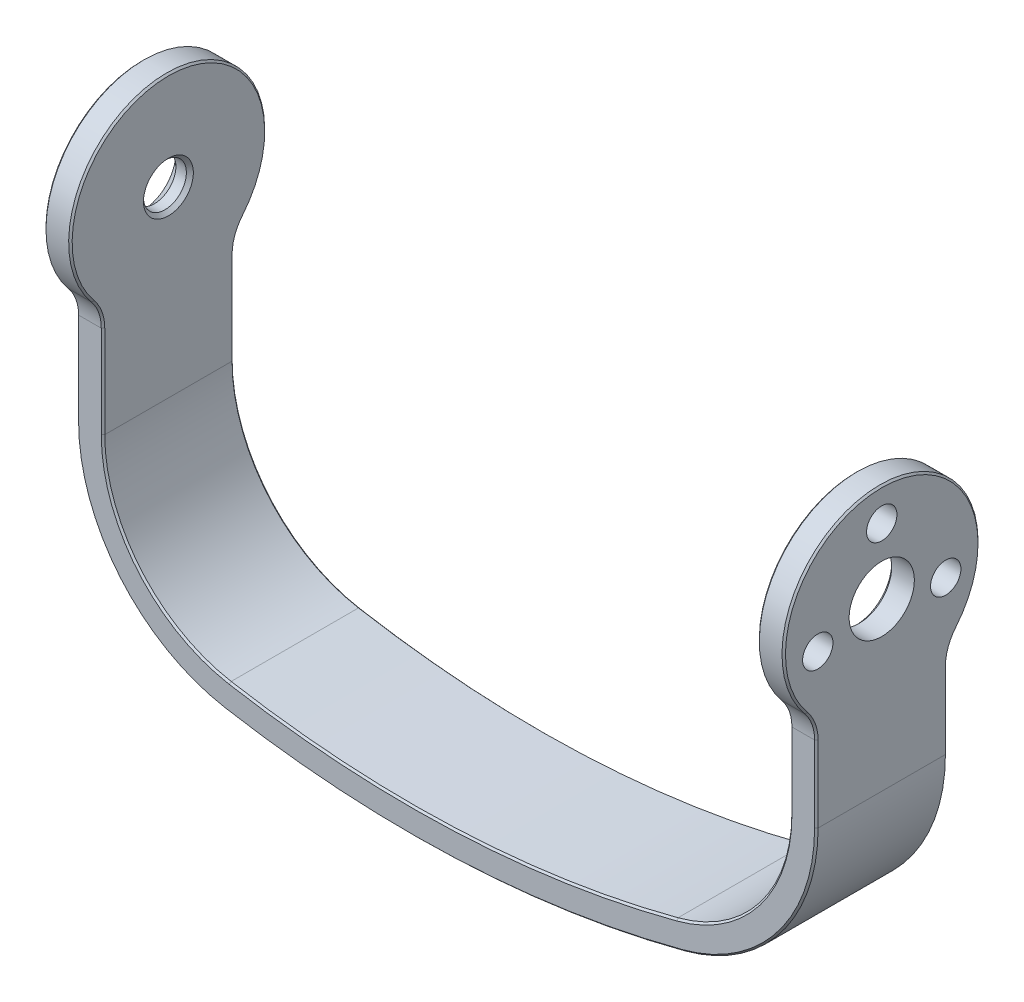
from build123d import *

# Parameters (mm, degrees)
BOSS_EXTRUDE1_DEPTH = 4.7625
SKETCH3_R           = 7.1374
BOSS_EXTRUDE3_DEPTH = 1.905
BOSS_EXTRUDE4_START = -51.943
SKETCH3_2_R         = 7.1374
BOSS_EXTRUDE4_DEPTH = 1.905
CUT_EXTRUDE1_REACH  = 62.796
SKETCH4_R           = 1.5621
CUT_EXTRUDE2_REACH  = 62.796
SKETCH5_R           = 2.3749
SKETCH5_R_2         = 1.1049
CHAMFER1_SIZE       = 0.254
CHAMFER2_SIZE       = 0.254
CHAMFER3_SIZE       = 0.889
FILLET1_R           = 3.175
CHAMFER4_SIZE       = 0.127


with BuildPart() as part:
    # Sketch1 → Boss-Extrude1 (new, symmetric)
    with BuildSketch(Plane.XY):
        with BuildLine():
            Line((-22.352, 0), (-22.352, -13.299052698))
            ThreePointArc((-22.352, -13.299052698), (-19.745105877, -20.455066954), (-13.146135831, -24.257438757))
            ThreePointArc((-13.146135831, -24.257438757), (3.196794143, -25.332913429), (19.392037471, -22.891172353))
            ThreePointArc((19.392037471, -22.891172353), (25.37182032, -18.924609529), (27.686, -12.132261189))
            Line((27.686, -12.132261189), (27.686, 0))
            Line((27.686, 0), (29.591, 0))
            Line((29.591, 0), (29.591, -12.132261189))
            ThreePointArc((29.591, -12.132261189), (26.880556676, -20.087682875), (19.876838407, -24.733451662))
            ThreePointArc((19.876838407, -24.733451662), (3.276713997, -27.236236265), (-13.474789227, -26.133874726))
            ThreePointArc((-13.474789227, -26.133874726), (-21.203719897, -21.68041186), (-24.257, -13.299052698))
            Line((-24.257, -13.299052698), (-24.257, 0))
            Line((-24.257, 0), (-22.352, 0))
        make_face()
    extrude(amount=BOSS_EXTRUDE1_DEPTH, both=True)

    # Sketch3 → Boss-Extrude3 (add)
    with BuildSketch(Plane.ZY.offset(24.257)):
        Circle(SKETCH3_R)
    extrude(amount=-BOSS_EXTRUDE3_DEPTH)

    # Sketch3_2 → Boss-Extrude4 (add)
    with BuildSketch(Plane.ZY.offset(24.257).offset(BOSS_EXTRUDE4_START)):
        Circle(SKETCH3_2_R)
    extrude(amount=-BOSS_EXTRUDE4_DEPTH)

    # Sketch4 → Cut-Extrude1 (cut, up to next)
    with BuildSketch(Plane.ZY.offset(24.257), mode=Mode.PRIVATE) as cut_extrude1_sk1:
        with Locations(Location((0, 0, 0), (0, 0, 270))):
            Circle(SKETCH4_R)
    cut_extrude1_tool1 = extrude(cut_extrude1_sk1.sketch, amount=-CUT_EXTRUDE1_REACH, mode=Mode.PRIVATE) & part.part
    add(cut_extrude1_tool1.solids().sort_by_distance((-24.257, 0, 0))[0], mode=Mode.SUBTRACT)

    # Sketch5 → Cut-Extrude2 (cut, up to next)
    with BuildSketch(Plane(origin=(29.591, 0, 0), x_dir=(0, 0, -1), z_dir=(1, 0, 0)), mode=Mode.PRIVATE) as cut_extrude2_sk1:
        Circle(SKETCH5_R)
    cut_extrude2_tool1 = extrude(cut_extrude2_sk1.sketch, amount=-CUT_EXTRUDE2_REACH, mode=Mode.PRIVATE) & part.part
    # Sketch5 → Cut-Extrude2 (cut, up to next)
    with BuildSketch(Plane(origin=(29.591, 0, 0), x_dir=(0, 0, -1), z_dir=(1, 0, 0)), mode=Mode.PRIVATE) as cut_extrude2_sk2:
        with Locations((0, 4.7625)):
            Circle(SKETCH5_R_2)
    cut_extrude2_tool2 = extrude(cut_extrude2_sk2.sketch, amount=-CUT_EXTRUDE2_REACH, mode=Mode.PRIVATE) & part.part
    # Sketch5 → Cut-Extrude2 (cut, up to next)
    with BuildSketch(Plane(origin=(29.591, 0, 0), x_dir=(0, 0, -1), z_dir=(1, 0, 0)), mode=Mode.PRIVATE) as cut_extrude2_sk3:
        with Locations((-4.658427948, -0.990179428)):
            Circle(SKETCH5_R_2)
    cut_extrude2_tool3 = extrude(cut_extrude2_sk3.sketch, amount=-CUT_EXTRUDE2_REACH, mode=Mode.PRIVATE) & part.part
    # Sketch5 → Cut-Extrude2 (cut, up to next)
    with BuildSketch(Plane(origin=(29.591, 0, 0), x_dir=(0, 0, -1), z_dir=(1, 0, 0)), mode=Mode.PRIVATE) as cut_extrude2_sk4:
        with Locations((4.658427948, -0.990179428)):
            Circle(SKETCH5_R_2)
    cut_extrude2_tool4 = extrude(cut_extrude2_sk4.sketch, amount=-CUT_EXTRUDE2_REACH, mode=Mode.PRIVATE) & part.part
    add(cut_extrude2_tool1.solids().sort_by_distance((29.591, 0, 0))[0], mode=Mode.SUBTRACT)
    add(cut_extrude2_tool2.solids().sort_by_distance((29.591, 4.7625, 0))[0], mode=Mode.SUBTRACT)
    add(cut_extrude2_tool3.solids().sort_by_distance((29.591, -0.990179, 4.658428))[0], mode=Mode.SUBTRACT)
    add(cut_extrude2_tool4.solids().sort_by_distance((29.591, -0.990179, -4.658428))[0], mode=Mode.SUBTRACT)

    # Chamfer1
    chamfer1_edges = [part.edges().sort_by_distance(p)[0] for p in [
        (27.686, 0, 2.3749),
    ]]
    chamfer(chamfer1_edges, length=CHAMFER1_SIZE)

    # Chamfer2
    chamfer2_edges = [part.edges().sort_by_distance(p)[0] for p in [
        (-22.352, 1.5621, 0),
    ]]
    chamfer(chamfer2_edges, length=CHAMFER2_SIZE)

    # Chamfer3
    chamfer3_edges = [part.edges().sort_by_distance(p)[0] for p in [
        (-24.257, 1.5621, 0),
    ]]
    chamfer(chamfer3_edges, length=CHAMFER3_SIZE)

    # Fillet1
    fillet1_edges = [part.edges().sort_by_distance(p)[0] for p in [
        (-23.3045, -5.316114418, -4.7625),
        (-23.3045, -5.316114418, 4.7625),
        (28.6385, -5.316114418, -4.7625),
        (28.6385, -5.316114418, 4.7625),
    ]]
    fillet(fillet1_edges, radius=FILLET1_R)

    # Chamfer4
    chamfer4_edges = [part.edges().sort_by_distance(p)[0] for p in [
        (-21.203719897, -21.68041186, 4.7625),
        (27.686, -9.357850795, 4.7625),
        (-24.257, -9.941246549, 4.7625),
        (-22.352, 7.1374, 0),
        (-24.257, 7.1374, 0),
        (29.591, -5.506053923, -4.950885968),
        (27.686, -5.506053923, -4.950885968),
        (29.591, -5.506053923, 4.950885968),
        (27.686, -5.506053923, 4.950885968),
        (-24.257, -5.506053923, -4.950885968),
        (-22.352, -5.506053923, -4.950885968),
        (-22.352, -9.941246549, -4.7625),
        (-24.257, -5.506053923, 4.950885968),
        (-22.352, -5.506053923, 4.950885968),
        (-19.745105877, -20.455066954, -4.7625),
        (3.196794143, -25.332913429, -4.7625),
        (25.37182032, -18.924609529, -4.7625),
        (3.276713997, -27.236236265, 4.7625),
        (29.591, -9.357850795, -4.7625),
        (26.880556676, -20.087682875, -4.7625),
        (3.276713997, -27.236236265, -4.7625),
        (-21.203719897, -21.68041186, -4.7625),
        (26.880556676, -20.087682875, 4.7625),
        (29.591, -9.357850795, 4.7625),
        (25.37182032, -18.924609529, 4.7625),
        (3.196794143, -25.332913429, 4.7625),
        (-19.745105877, -20.455066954, 4.7625),
        (-22.352, -9.941246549, 4.7625),
        (27.686, -9.357850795, -4.7625),
        (-24.257, -9.941246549, -4.7625),
        (27.686, 7.1374, 0),
        (29.591, 7.1374, 0),
    ]]
    chamfer(chamfer4_edges, length=CHAMFER4_SIZE)


solid = part.part
